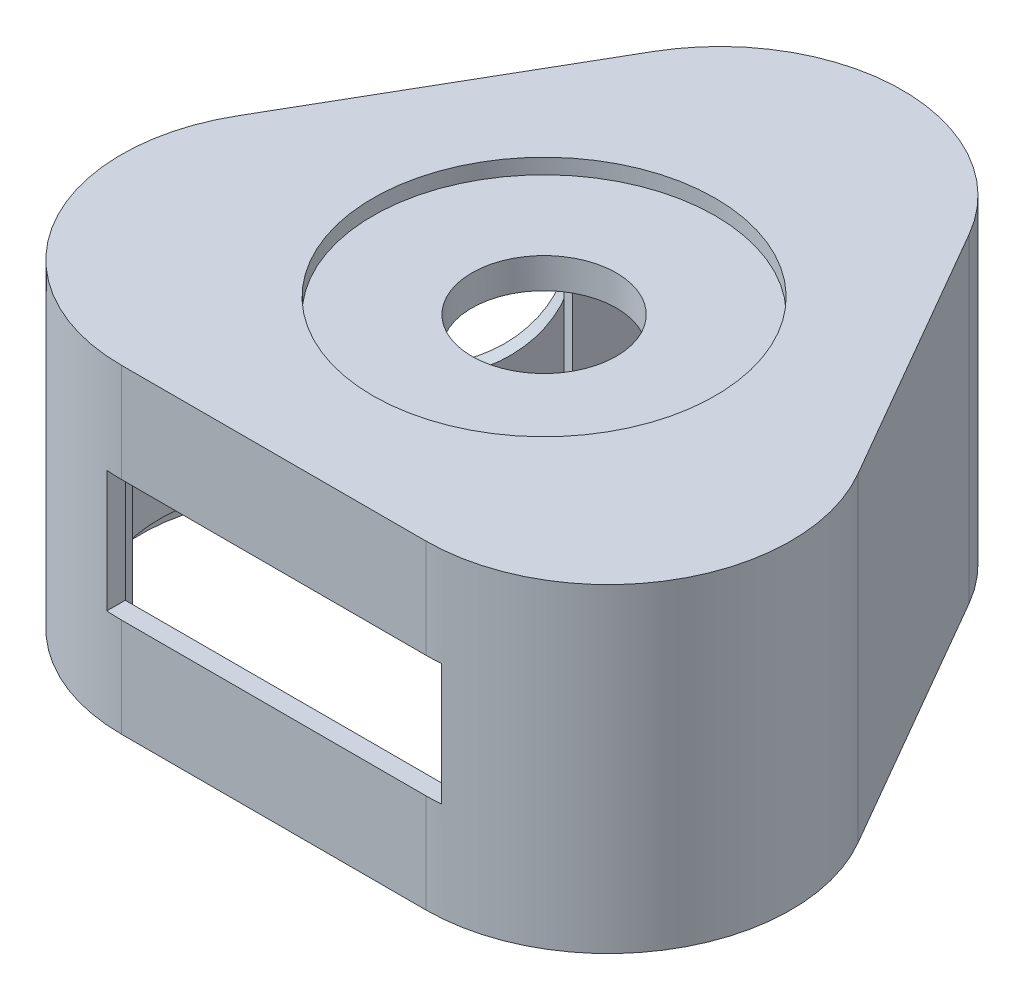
from build123d import *

# Parameters (mm, degrees)
EXTRUDE_1_DEPTH     = 21
CUT_EXTRUDE_1_DEPTH = 18
CUT_EXTRUDE_2_DEPTH = 1.5
SKETCH_4_R          = 4.75
CUT_EXTRUDE_3_DEPTH = 37.91153563
CUT_EXTRUDE_4_REACH = 52.497
SKETCH_5_R          = 5.5
SKETCH_7_R          = 11.25
CUT_EXTRUDE_6_DEPTH = 1
CUT_EXTRUDE_7_REACH = 53.307
SKETCH_8_W          = 22
SKETCH_8_H          = 8
SKETCH_9_W          = 24
SKETCH_9_H          = 11
CUT_EXTRUDE_8_DEPTH = 1.25
CHAMFER_1_SIZE      = 1.5
EXTRUDE_2_DEPTH     = 13.5


with BuildPart() as part:
    # Sketch 1 → Extrude 1 (new body)
    with BuildSketch(Plane(origin=(0, 0, 0), x_dir=(1, 0, 0), z_dir=(0, 1, 0))):
        with BuildLine():
            Line((10.392304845, 17.547005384), (20.392304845, 0.226497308))
            ThreePointArc((20.392304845, 0.226497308), (20.392304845, -11.773502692), (10, -17.773502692))
            Line((10, -17.773502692), (-10, -17.773502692))
            ThreePointArc((-10, -17.773502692), (-20.392304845, -11.773502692), (-20.392304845, 0.226497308))
            Line((-20.392304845, 0.226497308), (-10.392304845, 17.547005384))
            ThreePointArc((-10.392304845, 17.547005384), (0, 23.547005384), (10.392304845, 17.547005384))
        make_face()
    extrude(amount=EXTRUDE_1_DEPTH)

    # Sketch 2 → Cut-Extrude 1 (cut)
    with BuildSketch(Plane.XZ):
        with BuildLine():
            Line((-10, 15.273502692), (10, 15.273502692))
            ThreePointArc((10, 15.273502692), (18.227241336, 10.523502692), (18.227241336, 1.023502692))
            Line((18.227241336, 1.023502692), (8.227241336, -16.297005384))
            ThreePointArc((8.227241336, -16.297005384), (0, -21.047005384), (-8.227241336, -16.297005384))
            Line((-8.227241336, -16.297005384), (-18.227241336, 1.023502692))
            ThreePointArc((-18.227241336, 1.023502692), (-18.227241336, 10.523502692), (-10, 15.273502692))
        make_face()
    extrude(amount=-CUT_EXTRUDE_1_DEPTH, mode=Mode.SUBTRACT)

    # Sketch 3 → Cut-Extrude 2 (cut)
    with BuildSketch(Plane.XZ):
        with BuildLine():
            Line((9.309773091, -16.922005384), (19.309773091, 0.398502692))
            ThreePointArc((19.309773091, 0.398502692), (19.309773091, 11.148502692), (10, 16.523502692))
            Line((10, 16.523502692), (-10, 16.523502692))
            ThreePointArc((-10, 16.523502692), (-19.309773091, 11.148502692), (-19.309773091, 0.398502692))
            Line((-19.309773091, 0.398502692), (-9.309773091, -16.922005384))
            ThreePointArc((-9.309773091, -16.922005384), (0, -22.297005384), (9.309773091, -16.922005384))
        make_face()
    extrude(amount=-CUT_EXTRUDE_2_DEPTH, mode=Mode.SUBTRACT)

    # Sketch 4 → Cut-Extrude 3 (cut, through all)
    with BuildSketch(Plane.XZ.offset(-18)):
        with Locations(Location((0, 0, 0), (0, 0, 270))):
            Circle(SKETCH_4_R)
    extrude(amount=-CUT_EXTRUDE_3_DEPTH, mode=Mode.SUBTRACT)

    # Sketch 5 → Cut-Extrude 4 (cut, up to next)
    with BuildSketch(Plane(origin=(-15.392304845, 0, -8.886751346), x_dir=(-0.5000000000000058, 0, 0.8660254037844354), z_dir=(-0.8660254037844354, 0, -0.5000000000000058)), mode=Mode.PRIVATE) as cut_extrude_4_sk1:
        with Locations((0, 11.7)):
            Circle(SKETCH_5_R)
    cut_extrude_4_tool1 = extrude(cut_extrude_4_sk1.sketch, amount=-CUT_EXTRUDE_4_REACH, mode=Mode.PRIVATE) & part.part
    add(cut_extrude_4_tool1.solids().sort_by_distance((-15.392305, 11.7, -8.886751))[0], mode=Mode.SUBTRACT)

    # Sketch 7 → Cut-Extrude 6 (cut)
    with BuildSketch(Plane(origin=(0, 21, 0), x_dir=(1, 0, 0), z_dir=(0, 1, 0))):
        with Locations(Location((0, 0, 0), (0, 0, 270))):
            Circle(SKETCH_7_R)
    extrude(amount=-CUT_EXTRUDE_6_DEPTH, mode=Mode.SUBTRACT)

    # Sketch 8 → Cut-Extrude 7 (cut, up to next)
    with BuildSketch(Plane.XY.offset(17.773502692), mode=Mode.PRIVATE) as cut_extrude_7_sk1:
        with Locations((0, 10.5)):
            Rectangle(SKETCH_8_W, SKETCH_8_H)
    cut_extrude_7_tool1 = extrude(cut_extrude_7_sk1.sketch, amount=-CUT_EXTRUDE_7_REACH, mode=Mode.PRIVATE) & part.part
    add(cut_extrude_7_tool1.solids().sort_by_distance((0, 10.5, 17.773503))[0], mode=Mode.SUBTRACT)

    # Sketch 9 → Cut-Extrude 8 (cut, symmetric)
    with BuildSketch(Plane(origin=(0, 0, 15.273502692), x_dir=(-1, 0, 0), z_dir=(0, 0, -1))):
        with Locations((0, 10)):
            Rectangle(SKETCH_9_W, SKETCH_9_H)
    extrude(amount=CUT_EXTRUDE_8_DEPTH, both=True, mode=Mode.SUBTRACT)

    # Chamfer 1
    chamfer_1_edges = [part.edges().sort_by_distance(p)[0] for p in [
        (-12.642304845, 11.7, -13.649891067),
    ]]
    chamfer(chamfer_1_edges, length=CHAMFER_1_SIZE)

    # Sketch 10 → Extrude 2 (add)
    with BuildSketch(Plane.XZ.offset(-18)):
        Polygon((-17.227241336, -0.708548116), (-15.977241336, -2.873611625), (-13.985382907, -1.723611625), (-14.360382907, -1.074092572), (-11.329293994, 0.675907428), (-9.954293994, -1.705662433), (-8.655255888, -0.955662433), (-10.905255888, 2.941451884), align=None)
        Polygon((-9.227241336, -14.564954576), (-2.905255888, -10.914954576), (-5.155255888, -7.017840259), (-6.454293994, -7.767840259), (-5.079293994, -10.14941012), (-8.110382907, -11.89941012), (-8.485382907, -11.249891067), (-10.477241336, -12.399891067), align=None)
    extrude(amount=EXTRUDE_2_DEPTH)


solid = part.part
